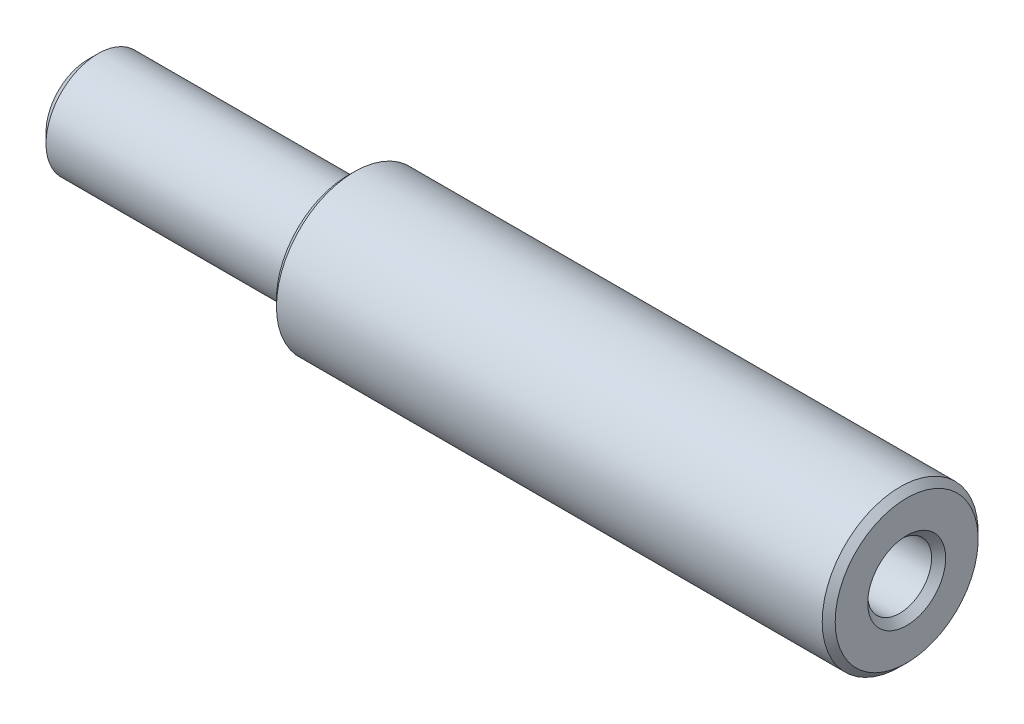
ISO-10303-21;
HEADER;
FILE_DESCRIPTION(('STEP AP214'),'2;1');
FILE_NAME('part.step','',(''),(''),'','','');
FILE_SCHEMA(('AUTOMOTIVE_DESIGN { 1 0 10303 214 1 1 1 1 }'));
ENDSEC;
DATA;
#1=APPLICATION_CONTEXT('core data for automotive mechanical design processes');
#2=APPLICATION_PROTOCOL_DEFINITION('international standard','automotive_design',2000,#1);
#3=PRODUCT_CONTEXT('',#1,'mechanical');
#4=PRODUCT('Part','Part','',(#3));
#5=PRODUCT_RELATED_PRODUCT_CATEGORY('part','',(#4));
#6=PRODUCT_DEFINITION_FORMATION('','',#4);
#7=PRODUCT_DEFINITION_CONTEXT('part definition',#1,'design');
#8=PRODUCT_DEFINITION('design','',#6,#7);
#9=PRODUCT_DEFINITION_SHAPE('','',#8);
#10=(LENGTH_UNIT() NAMED_UNIT(*) SI_UNIT(.MILLI.,.METRE.));
#11=(NAMED_UNIT(*) PLANE_ANGLE_UNIT() SI_UNIT($,.RADIAN.));
#12=(NAMED_UNIT(*) SI_UNIT($,.STERADIAN.) SOLID_ANGLE_UNIT());
#13=UNCERTAINTY_MEASURE_WITH_UNIT(LENGTH_MEASURE(1.E-05),#10,'distance_accuracy_value','');
#14=(GEOMETRIC_REPRESENTATION_CONTEXT(3) GLOBAL_UNCERTAINTY_ASSIGNED_CONTEXT((#13)) GLOBAL_UNIT_ASSIGNED_CONTEXT((#10,
#11,#12)) REPRESENTATION_CONTEXT('',''));
#15=CARTESIAN_POINT('',(0.,0.,0.));
#16=DIRECTION('',(0.,0.,1.));
#17=DIRECTION('',(1.,0.,0.));
#18=AXIS2_PLACEMENT_3D('',#15,#16,#17);
#19=CARTESIAN_POINT('',(-20.,0.,0.));
#20=DIRECTION('',(1.,0.,0.));
#21=DIRECTION('',(0.,0.,-1.));
#22=AXIS2_PLACEMENT_3D('',#19,#20,#21);
#23=PLANE('',#22);
#24=CARTESIAN_POINT('',(-19.9999999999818,0.,0.));
#25=DIRECTION('',(1.,0.,0.));
#26=DIRECTION('',(0.,0.,-1.));
#27=AXIS2_PLACEMENT_3D('',#24,#25,#26);
#28=CIRCLE('',#27,3.23300000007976);
#29=CARTESIAN_POINT('',(-19.9999999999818,0.,-3.23300000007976));
#30=VERTEX_POINT('',#29);
#31=EDGE_CURVE('E19',#30,#30,#28,.T.);
#32=ORIENTED_EDGE('',*,*,#31,.F.);
#33=EDGE_LOOP('',(#32));
#34=FACE_BOUND('',#33,.T.);
#35=ADVANCED_FACE('F16',(#34),#23,.F.);
#36=CARTESIAN_POINT('',(25.4194156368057,0.,0.));
#37=DIRECTION('',(1.,0.,0.));
#38=DIRECTION('',(0.,1.,0.));
#39=AXIS2_PLACEMENT_3D('',#36,#37,#38);
#40=CONICAL_SURFACE('',#39,2.45849999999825,1.04719755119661);
#41=CARTESIAN_POINT('',(24.0000000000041,0.,0.));
#42=VERTEX_POINT('',#41);
#43=VERTEX_LOOP('',#42);
#44=FACE_BOUND('',#43,.T.);
#45=CARTESIAN_POINT('',(25.4194156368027,0.,0.));
#46=DIRECTION('',(-1.,0.,0.));
#47=DIRECTION('',(0.,0.,1.));
#48=AXIS2_PLACEMENT_3D('',#45,#46,#47);
#49=CIRCLE('',#48,2.4585);
#50=CARTESIAN_POINT('',(25.4194156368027,0.,2.4585));
#51=VERTEX_POINT('',#50);
#52=EDGE_CURVE('E33',#51,#51,#49,.F.);
#53=ORIENTED_EDGE('',*,*,#52,.T.);
#54=EDGE_LOOP('',(#53));
#55=FACE_BOUND('',#54,.T.);
#56=ADVANCED_FACE('F27',(#44,#55),#40,.F.);
#57=CARTESIAN_POINT('',(-19.2330000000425,0.,0.));
#58=DIRECTION('',(1.,0.,0.));
#59=DIRECTION('',(0.,0.,-1.));
#60=AXIS2_PLACEMENT_3D('',#57,#58,#59);
#61=CONICAL_SURFACE('',#60,4.0000000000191,0.785398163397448);
#62=ORIENTED_EDGE('',*,*,#31,.T.);
#63=EDGE_LOOP('',(#62));
#64=FACE_BOUND('',#63,.T.);
#65=CARTESIAN_POINT('',(-19.233,0.,0.));
#66=DIRECTION('',(-1.,0.,0.));
#67=DIRECTION('',(0.,0.,1.));
#68=AXIS2_PLACEMENT_3D('',#65,#66,#67);
#69=CIRCLE('',#68,4.);
#70=CARTESIAN_POINT('',(-19.233,0.,4.));
#71=VERTEX_POINT('',#70);
#72=EDGE_CURVE('E35',#71,#71,#69,.F.);
#73=ORIENTED_EDGE('',*,*,#72,.F.);
#74=EDGE_LOOP('',(#73));
#75=FACE_BOUND('',#74,.T.);
#76=ADVANCED_FACE('F30',(#64,#75),#61,.T.);
#77=CARTESIAN_POINT('',(43.,0.,0.));
#78=DIRECTION('',(-1.,0.,0.));
#79=DIRECTION('',(0.,0.,1.));
#80=AXIS2_PLACEMENT_3D('',#77,#78,#79);
#81=CYLINDRICAL_SURFACE('',#80,2.4585);
#82=ORIENTED_EDGE('',*,*,#52,.F.);
#83=EDGE_LOOP('',(#82));
#84=FACE_BOUND('',#83,.T.);
#85=CARTESIAN_POINT('',(42.4585000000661,0.,0.));
#86=DIRECTION('',(1.,0.,0.));
#87=DIRECTION('',(0.,0.,-1.));
#88=AXIS2_PLACEMENT_3D('',#85,#86,#87);
#89=CIRCLE('',#88,2.45849999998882);
#90=CARTESIAN_POINT('',(42.4585000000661,0.,-2.45849999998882));
#91=VERTEX_POINT('',#90);
#92=EDGE_CURVE('E38',#91,#91,#89,.T.);
#93=ORIENTED_EDGE('',*,*,#92,.T.);
#94=EDGE_LOOP('',(#93));
#95=FACE_BOUND('',#94,.T.);
#96=ADVANCED_FACE('F97',(#84,#95),#81,.F.);
#97=CARTESIAN_POINT('',(43.,0.,0.));
#98=DIRECTION('',(-1.,0.,0.));
#99=DIRECTION('',(0.,0.,1.));
#100=AXIS2_PLACEMENT_3D('',#97,#98,#99);
#101=CYLINDRICAL_SURFACE('',#100,4.);
#102=ORIENTED_EDGE('',*,*,#72,.T.);
#103=EDGE_LOOP('',(#102));
#104=FACE_BOUND('',#103,.T.);
#105=CARTESIAN_POINT('',(-0.300000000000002,0.,0.));
#106=DIRECTION('',(1.,0.,0.));
#107=DIRECTION('',(0.,0.,-1.));
#108=AXIS2_PLACEMENT_3D('',#105,#106,#107);
#109=CIRCLE('',#108,4.);
#110=CARTESIAN_POINT('',(-0.300000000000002,0.,-4.));
#111=VERTEX_POINT('',#110);
#112=EDGE_CURVE('E54',#111,#111,#109,.F.);
#113=ORIENTED_EDGE('',*,*,#112,.T.);
#114=EDGE_LOOP('',(#113));
#115=FACE_BOUND('',#114,.T.);
#116=ADVANCED_FACE('F93',(#104,#115),#101,.T.);
#117=CARTESIAN_POINT('',(43.0000000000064,0.,0.));
#118=DIRECTION('',(1.,0.,0.));
#119=DIRECTION('',(0.,0.,-1.));
#120=AXIS2_PLACEMENT_3D('',#117,#118,#119);
#121=CONICAL_SURFACE('',#120,2.99999999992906,0.785398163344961);
#122=ORIENTED_EDGE('',*,*,#92,.F.);
#123=EDGE_LOOP('',(#122));
#124=FACE_BOUND('',#123,.T.);
#125=CARTESIAN_POINT('',(43.0000000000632,0.,0.));
#126=DIRECTION('',(1.,0.,0.));
#127=DIRECTION('',(0.,0.,-1.));
#128=AXIS2_PLACEMENT_3D('',#125,#126,#127);
#129=CIRCLE('',#128,2.9999999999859);
#130=CARTESIAN_POINT('',(43.0000000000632,0.,-2.9999999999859));
#131=VERTEX_POINT('',#130);
#132=EDGE_CURVE('E52',#131,#131,#129,.T.);
#133=ORIENTED_EDGE('',*,*,#132,.T.);
#134=EDGE_LOOP('',(#133));
#135=FACE_BOUND('',#134,.T.);
#136=ADVANCED_FACE('F88',(#124,#135),#121,.F.);
#137=CARTESIAN_POINT('',(-0.300000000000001,0.,0.));
#138=DIRECTION('',(1.,0.,0.));
#139=DIRECTION('',(0.,0.,-1.));
#140=AXIS2_PLACEMENT_3D('',#137,#138,#139);
#141=TOROIDAL_SURFACE('',#140,4.3,0.300000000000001);
#142=ORIENTED_EDGE('',*,*,#112,.F.);
#143=EDGE_LOOP('',(#142));
#144=FACE_BOUND('',#143,.T.);
#145=CARTESIAN_POINT('',(0.,0.,0.));
#146=DIRECTION('',(-1.,0.,0.));
#147=DIRECTION('',(0.,0.,-1.));
#148=AXIS2_PLACEMENT_3D('',#145,#146,#147);
#149=CIRCLE('',#148,4.3);
#150=CARTESIAN_POINT('',(0.,0.,-4.3));
#151=VERTEX_POINT('',#150);
#152=EDGE_CURVE('E51',#151,#151,#149,.T.);
#153=ORIENTED_EDGE('',*,*,#152,.T.);
#154=EDGE_LOOP('',(#153));
#155=FACE_BOUND('',#154,.T.);
#156=ADVANCED_FACE('F77',(#144,#155),#141,.F.);
#157=CARTESIAN_POINT('',(43.,5.5,0.));
#158=DIRECTION('',(-1.,0.,0.));
#159=DIRECTION('',(0.,0.,1.));
#160=AXIS2_PLACEMENT_3D('',#157,#158,#159);
#161=PLANE('',#160);
#162=CARTESIAN_POINT('',(43.0000000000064,0.,0.));
#163=DIRECTION('',(-1.,0.,0.));
#164=DIRECTION('',(0.,0.,1.));
#165=AXIS2_PLACEMENT_3D('',#162,#163,#164);
#166=CIRCLE('',#165,5.49999999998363);
#167=CARTESIAN_POINT('',(43.0000000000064,0.,5.49999999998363));
#168=VERTEX_POINT('',#167);
#169=EDGE_CURVE('E49',#168,#168,#166,.T.);
#170=ORIENTED_EDGE('',*,*,#169,.F.);
#171=EDGE_LOOP('',(#170));
#172=FACE_BOUND('',#171,.T.);
#173=ORIENTED_EDGE('',*,*,#132,.F.);
#174=EDGE_LOOP('',(#173));
#175=FACE_BOUND('',#174,.T.);
#176=ADVANCED_FACE('F87',(#172,#175),#161,.F.);
#177=CARTESIAN_POINT('',(0.,4.3,0.));
#178=DIRECTION('',(1.,0.,0.));
#179=DIRECTION('',(0.,0.,-1.));
#180=AXIS2_PLACEMENT_3D('',#177,#178,#179);
#181=PLANE('',#180);
#182=ORIENTED_EDGE('',*,*,#152,.F.);
#183=EDGE_LOOP('',(#182));
#184=FACE_BOUND('',#183,.T.);
#185=CARTESIAN_POINT('',(0.,0.,0.));
#186=DIRECTION('',(1.,0.,0.));
#187=DIRECTION('',(0.,0.,-1.));
#188=AXIS2_PLACEMENT_3D('',#185,#186,#187);
#189=CIRCLE('',#188,5.49999999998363);
#190=CARTESIAN_POINT('',(0.,0.,-5.49999999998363));
#191=VERTEX_POINT('',#190);
#192=EDGE_CURVE('E46',#191,#191,#189,.T.);
#193=ORIENTED_EDGE('',*,*,#192,.F.);
#194=EDGE_LOOP('',(#193));
#195=FACE_BOUND('',#194,.T.);
#196=ADVANCED_FACE('F121',(#184,#195),#181,.F.);
#197=CARTESIAN_POINT('',(42.4999999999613,0.,0.));
#198=DIRECTION('',(-1.,0.,0.));
#199=DIRECTION('',(0.,0.,1.));
#200=AXIS2_PLACEMENT_3D('',#197,#198,#199);
#201=CONICAL_SURFACE('',#200,6.00000000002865,0.785398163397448);
#202=CARTESIAN_POINT('',(42.5,0.,0.));
#203=DIRECTION('',(-1.,0.,0.));
#204=DIRECTION('',(0.,0.,1.));
#205=AXIS2_PLACEMENT_3D('',#202,#203,#204);
#206=CIRCLE('',#205,6.);
#207=CARTESIAN_POINT('',(42.5,0.,6.));
#208=VERTEX_POINT('',#207);
#209=EDGE_CURVE('E23',#208,#208,#206,.T.);
#210=ORIENTED_EDGE('',*,*,#209,.F.);
#211=EDGE_LOOP('',(#210));
#212=FACE_BOUND('',#211,.T.);
#213=ORIENTED_EDGE('',*,*,#169,.T.);
#214=EDGE_LOOP('',(#213));
#215=FACE_BOUND('',#214,.T.);
#216=ADVANCED_FACE('F115',(#212,#215),#201,.T.);
#217=CARTESIAN_POINT('',(0.500000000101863,0.,0.));
#218=DIRECTION('',(1.,0.,0.));
#219=DIRECTION('',(0.,0.,-1.));
#220=AXIS2_PLACEMENT_3D('',#217,#218,#219);
#221=CONICAL_SURFACE('',#220,6.00000000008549,0.785398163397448);
#222=ORIENTED_EDGE('',*,*,#192,.T.);
#223=EDGE_LOOP('',(#222));
#224=FACE_BOUND('',#223,.T.);
#225=CARTESIAN_POINT('',(0.5,0.,0.));
#226=DIRECTION('',(-1.,0.,0.));
#227=DIRECTION('',(0.,0.,1.));
#228=AXIS2_PLACEMENT_3D('',#225,#226,#227);
#229=CIRCLE('',#228,6.);
#230=CARTESIAN_POINT('',(0.5,0.,6.));
#231=VERTEX_POINT('',#230);
#232=EDGE_CURVE('E11',#231,#231,#229,.F.);
#233=ORIENTED_EDGE('',*,*,#232,.F.);
#234=EDGE_LOOP('',(#233));
#235=FACE_BOUND('',#234,.T.);
#236=ADVANCED_FACE('F109',(#224,#235),#221,.T.);
#237=CARTESIAN_POINT('',(43.,0.,0.));
#238=DIRECTION('',(-1.,0.,0.));
#239=DIRECTION('',(0.,0.,1.));
#240=AXIS2_PLACEMENT_3D('',#237,#238,#239);
#241=CYLINDRICAL_SURFACE('',#240,6.);
#242=ORIENTED_EDGE('',*,*,#232,.T.);
#243=EDGE_LOOP('',(#242));
#244=FACE_BOUND('',#243,.T.);
#245=ORIENTED_EDGE('',*,*,#209,.T.);
#246=EDGE_LOOP('',(#245));
#247=FACE_BOUND('',#246,.T.);
#248=ADVANCED_FACE('F107',(#244,#247),#241,.T.);
#249=CLOSED_SHELL('',(#35,#56,#76,#96,#116,#136,#156,#176,#196,#216,#236,#248));
#250=MANIFOLD_SOLID_BREP('B1',#249);
#251=ADVANCED_BREP_SHAPE_REPRESENTATION('',(#18,#250),#14);
#252=SHAPE_DEFINITION_REPRESENTATION(#9,#251);
ENDSEC;
END-ISO-10303-21;
